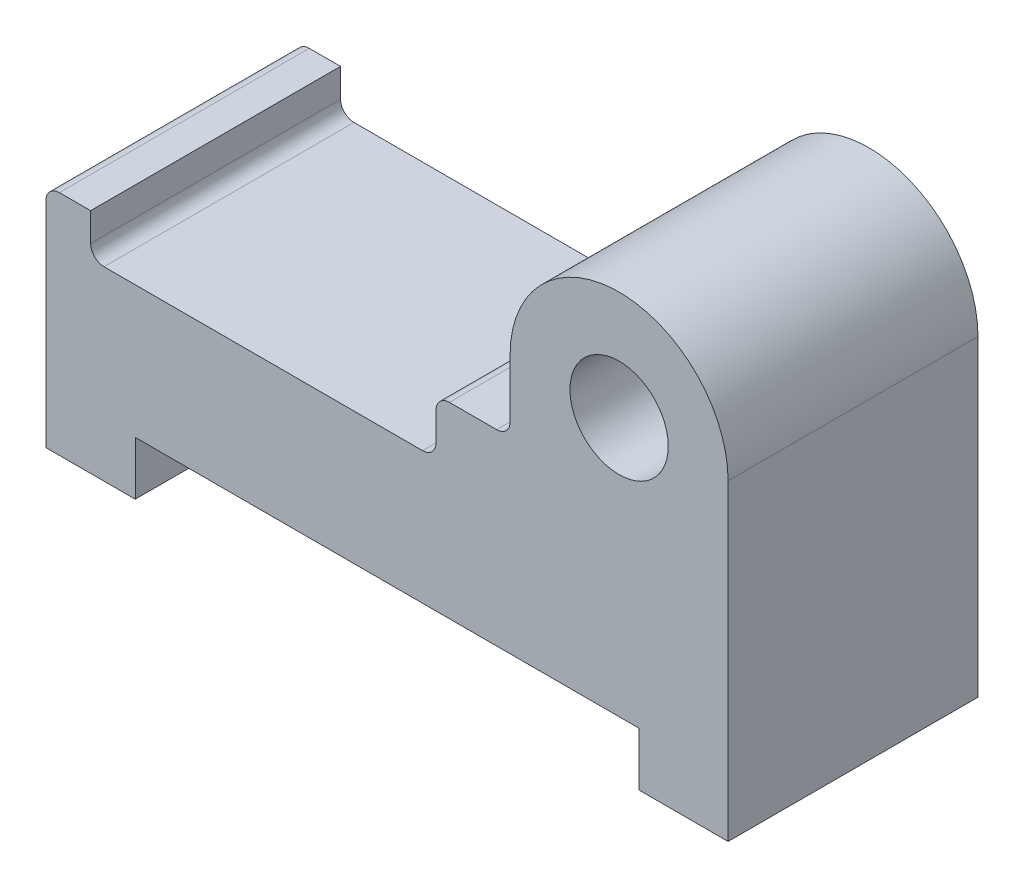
ISO-10303-21;
HEADER;
FILE_DESCRIPTION(('STEP AP214'),'2;1');
FILE_NAME('part.step','',(''),(''),'','','');
FILE_SCHEMA(('AUTOMOTIVE_DESIGN { 1 0 10303 214 1 1 1 1 }'));
ENDSEC;
DATA;
#1=APPLICATION_CONTEXT('core data for automotive mechanical design processes');
#2=APPLICATION_PROTOCOL_DEFINITION('international standard','automotive_design',2000,#1);
#3=PRODUCT_CONTEXT('',#1,'mechanical');
#4=PRODUCT('Part','Part','',(#3));
#5=PRODUCT_RELATED_PRODUCT_CATEGORY('part','',(#4));
#6=PRODUCT_DEFINITION_FORMATION('','',#4);
#7=PRODUCT_DEFINITION_CONTEXT('part definition',#1,'design');
#8=PRODUCT_DEFINITION('design','',#6,#7);
#9=PRODUCT_DEFINITION_SHAPE('','',#8);
#10=(LENGTH_UNIT() NAMED_UNIT(*) SI_UNIT(.MILLI.,.METRE.));
#11=(NAMED_UNIT(*) PLANE_ANGLE_UNIT() SI_UNIT($,.RADIAN.));
#12=(NAMED_UNIT(*) SI_UNIT($,.STERADIAN.) SOLID_ANGLE_UNIT());
#13=UNCERTAINTY_MEASURE_WITH_UNIT(LENGTH_MEASURE(1.E-05),#10,'distance_accuracy_value','');
#14=(GEOMETRIC_REPRESENTATION_CONTEXT(3) GLOBAL_UNCERTAINTY_ASSIGNED_CONTEXT((#13)) GLOBAL_UNIT_ASSIGNED_CONTEXT((#10,
#11,#12)) REPRESENTATION_CONTEXT('',''));
#15=CARTESIAN_POINT('',(0.,0.,0.));
#16=DIRECTION('',(0.,0.,1.));
#17=DIRECTION('',(1.,0.,0.));
#18=AXIS2_PLACEMENT_3D('',#15,#16,#17);
#19=CARTESIAN_POINT('',(128.425075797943,70.,56.));
#20=DIRECTION('',(0.,0.,1.));
#21=DIRECTION('',(1.,0.,0.));
#22=AXIS2_PLACEMENT_3D('',#19,#20,#21);
#23=PLANE('',#22);
#24=DIRECTION('',(0.,-1.,0.));
#25=VECTOR('',#24,1.);
#26=CARTESIAN_POINT('',(0.,48.,56.));
#27=LINE('',#26,#25);
#28=CARTESIAN_POINT('',(0.,48.,56.));
#29=VERTEX_POINT('',#28);
#30=CARTESIAN_POINT('',(0.,0.,56.));
#31=VERTEX_POINT('',#30);
#32=EDGE_CURVE('E230',#29,#31,#27,.T.);
#33=ORIENTED_EDGE('',*,*,#32,.T.);
#34=DIRECTION('',(1.,0.,0.));
#35=VECTOR('',#34,1.);
#36=CARTESIAN_POINT('',(0.,0.,56.));
#37=LINE('',#36,#35);
#38=CARTESIAN_POINT('',(20.,0.,56.));
#39=VERTEX_POINT('',#38);
#40=EDGE_CURVE('E123',#31,#39,#37,.T.);
#41=ORIENTED_EDGE('',*,*,#40,.T.);
#42=DIRECTION('',(0.,1.,0.));
#43=VECTOR('',#42,1.);
#44=CARTESIAN_POINT('',(20.,0.,56.));
#45=LINE('',#44,#43);
#46=CARTESIAN_POINT('',(20.,12.,56.));
#47=VERTEX_POINT('',#46);
#48=EDGE_CURVE('E278',#39,#47,#45,.T.);
#49=ORIENTED_EDGE('',*,*,#48,.T.);
#50=DIRECTION('',(1.,0.,0.));
#51=VECTOR('',#50,1.);
#52=CARTESIAN_POINT('',(20.,12.,56.));
#53=LINE('',#52,#51);
#54=CARTESIAN_POINT('',(132.850151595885,12.,56.));
#55=VERTEX_POINT('',#54);
#56=EDGE_CURVE('E297',#47,#55,#53,.T.);
#57=ORIENTED_EDGE('',*,*,#56,.T.);
#58=DIRECTION('',(0.,-1.,0.));
#59=VECTOR('',#58,1.);
#60=CARTESIAN_POINT('',(132.850151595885,12.,56.));
#61=LINE('',#60,#59);
#62=CARTESIAN_POINT('',(132.850151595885,0.,56.));
#63=VERTEX_POINT('',#62);
#64=EDGE_CURVE('E294',#55,#63,#61,.T.);
#65=ORIENTED_EDGE('',*,*,#64,.T.);
#66=DIRECTION('',(1.,0.,0.));
#67=VECTOR('',#66,1.);
#68=CARTESIAN_POINT('',(132.850151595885,0.,56.));
#69=LINE('',#68,#67);
#70=CARTESIAN_POINT('',(152.850151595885,0.,56.));
#71=VERTEX_POINT('',#70);
#72=EDGE_CURVE('E296',#63,#71,#69,.T.);
#73=ORIENTED_EDGE('',*,*,#72,.T.);
#74=DIRECTION('',(0.,1.,0.));
#75=VECTOR('',#74,1.);
#76=CARTESIAN_POINT('',(152.850151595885,0.,56.));
#77=LINE('',#76,#75);
#78=CARTESIAN_POINT('',(152.850151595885,70.,56.));
#79=VERTEX_POINT('',#78);
#80=EDGE_CURVE('E299',#71,#79,#77,.T.);
#81=ORIENTED_EDGE('',*,*,#80,.T.);
#82=CARTESIAN_POINT('',(128.425075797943,70.,56.));
#83=DIRECTION('',(0.,0.,1.));
#84=DIRECTION('',(1.,0.,0.));
#85=AXIS2_PLACEMENT_3D('',#82,#83,#84);
#86=CIRCLE('',#85,24.4250757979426);
#87=CARTESIAN_POINT('',(104.,70.,56.));
#88=VERTEX_POINT('',#87);
#89=EDGE_CURVE('E305',#79,#88,#86,.T.);
#90=ORIENTED_EDGE('',*,*,#89,.T.);
#91=DIRECTION('',(0.,-1.,0.));
#92=VECTOR('',#91,1.);
#93=CARTESIAN_POINT('',(104.,70.,56.));
#94=LINE('',#93,#92);
#95=CARTESIAN_POINT('',(104.,57.,56.));
#96=VERTEX_POINT('',#95);
#97=EDGE_CURVE('E307',#88,#96,#94,.T.);
#98=ORIENTED_EDGE('',*,*,#97,.T.);
#99=CARTESIAN_POINT('',(101.,57.,56.));
#100=DIRECTION('',(0.,0.,-1.));
#101=DIRECTION('',(-1.,0.,0.));
#102=AXIS2_PLACEMENT_3D('',#99,#100,#101);
#103=CIRCLE('',#102,3.00000000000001);
#104=CARTESIAN_POINT('',(101.,54.,56.));
#105=VERTEX_POINT('',#104);
#106=EDGE_CURVE('E309',#96,#105,#103,.T.);
#107=ORIENTED_EDGE('',*,*,#106,.T.);
#108=DIRECTION('',(-1.,0.,0.));
#109=VECTOR('',#108,1.);
#110=CARTESIAN_POINT('',(101.,54.,56.));
#111=LINE('',#110,#109);
#112=CARTESIAN_POINT('',(90.3994983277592,54.,56.));
#113=VERTEX_POINT('',#112);
#114=EDGE_CURVE('E311',#105,#113,#111,.T.);
#115=ORIENTED_EDGE('',*,*,#114,.T.);
#116=CARTESIAN_POINT('',(90.3994983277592,51.,56.));
#117=DIRECTION('',(0.,0.,1.));
#118=DIRECTION('',(1.,0.,0.));
#119=AXIS2_PLACEMENT_3D('',#116,#117,#118);
#120=CIRCLE('',#119,3.);
#121=CARTESIAN_POINT('',(87.3994983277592,51.,56.));
#122=VERTEX_POINT('',#121);
#123=EDGE_CURVE('E313',#113,#122,#120,.T.);
#124=ORIENTED_EDGE('',*,*,#123,.T.);
#125=DIRECTION('',(0.,-1.,0.));
#126=VECTOR('',#125,1.);
#127=CARTESIAN_POINT('',(87.3994983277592,51.,56.));
#128=LINE('',#127,#126);
#129=CARTESIAN_POINT('',(87.3994983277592,44.6174543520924,56.));
#130=VERTEX_POINT('',#129);
#131=EDGE_CURVE('E315',#122,#130,#128,.T.);
#132=ORIENTED_EDGE('',*,*,#131,.T.);
#133=CARTESIAN_POINT('',(84.3994983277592,44.6174543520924,56.));
#134=DIRECTION('',(0.,0.,-1.));
#135=DIRECTION('',(-1.,0.,0.));
#136=AXIS2_PLACEMENT_3D('',#133,#134,#135);
#137=CIRCLE('',#136,3.);
#138=CARTESIAN_POINT('',(84.3994983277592,41.6174543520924,56.));
#139=VERTEX_POINT('',#138);
#140=EDGE_CURVE('E317',#130,#139,#137,.T.);
#141=ORIENTED_EDGE('',*,*,#140,.T.);
#142=DIRECTION('',(-1.,0.,0.));
#143=VECTOR('',#142,1.);
#144=CARTESIAN_POINT('',(84.3994983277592,41.6174543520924,56.));
#145=LINE('',#144,#143);
#146=CARTESIAN_POINT('',(13.,41.6174543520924,56.));
#147=VERTEX_POINT('',#146);
#148=EDGE_CURVE('E319',#139,#147,#145,.T.);
#149=ORIENTED_EDGE('',*,*,#148,.T.);
#150=CARTESIAN_POINT('',(13.,44.6174543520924,56.));
#151=DIRECTION('',(0.,0.,-1.));
#152=DIRECTION('',(-1.,0.,0.));
#153=AXIS2_PLACEMENT_3D('',#150,#151,#152);
#154=CIRCLE('',#153,3.);
#155=CARTESIAN_POINT('',(10.,44.6174543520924,56.));
#156=VERTEX_POINT('',#155);
#157=EDGE_CURVE('E175',#147,#156,#154,.T.);
#158=ORIENTED_EDGE('',*,*,#157,.T.);
#159=DIRECTION('',(0.,1.,0.));
#160=VECTOR('',#159,1.);
#161=CARTESIAN_POINT('',(10.,44.6174543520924,56.));
#162=LINE('',#161,#160);
#163=CARTESIAN_POINT('',(10.,51.,56.));
#164=VERTEX_POINT('',#163);
#165=EDGE_CURVE('E169',#156,#164,#162,.T.);
#166=ORIENTED_EDGE('',*,*,#165,.T.);
#167=DIRECTION('',(-1.,0.,0.));
#168=VECTOR('',#167,1.);
#169=CARTESIAN_POINT('',(10.,51.,56.));
#170=LINE('',#169,#168);
#171=CARTESIAN_POINT('',(3.,51.,56.));
#172=VERTEX_POINT('',#171);
#173=EDGE_CURVE('E173',#164,#172,#170,.T.);
#174=ORIENTED_EDGE('',*,*,#173,.T.);
#175=CARTESIAN_POINT('',(3.,48.,56.));
#176=DIRECTION('',(0.,0.,1.));
#177=DIRECTION('',(1.,0.,0.));
#178=AXIS2_PLACEMENT_3D('',#175,#176,#177);
#179=CIRCLE('',#178,3.);
#180=EDGE_CURVE('E47',#172,#29,#179,.T.);
#181=ORIENTED_EDGE('',*,*,#180,.T.);
#182=EDGE_LOOP('',(#33,#41,#49,#57,#65,#73,#81,#90,#98,#107,#115,#124,#132,#141,#149,#158,#166,
#174,#181));
#183=FACE_BOUND('',#182,.T.);
#184=CARTESIAN_POINT('',(128.425075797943,70.,56.));
#185=DIRECTION('',(0.,0.,1.));
#186=DIRECTION('',(1.,0.,0.));
#187=AXIS2_PLACEMENT_3D('',#184,#185,#186);
#188=CIRCLE('',#187,11.0137221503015);
#189=CARTESIAN_POINT('',(139.438797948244,70.,56.));
#190=VERTEX_POINT('',#189);
#191=EDGE_CURVE('E197',#190,#190,#188,.T.);
#192=ORIENTED_EDGE('',*,*,#191,.F.);
#193=EDGE_LOOP('',(#192));
#194=FACE_BOUND('',#193,.T.);
#195=ADVANCED_FACE('F30',(#183,#194),#23,.T.);
#196=CARTESIAN_POINT('',(128.425075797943,70.,0.));
#197=DIRECTION('',(0.,0.,1.));
#198=DIRECTION('',(1.,0.,0.));
#199=AXIS2_PLACEMENT_3D('',#196,#197,#198);
#200=PLANE('',#199);
#201=DIRECTION('',(0.,-1.,0.));
#202=VECTOR('',#201,1.);
#203=CARTESIAN_POINT('',(0.,48.,0.));
#204=LINE('',#203,#202);
#205=CARTESIAN_POINT('',(0.,48.,0.));
#206=VERTEX_POINT('',#205);
#207=CARTESIAN_POINT('',(0.,0.,0.));
#208=VERTEX_POINT('',#207);
#209=EDGE_CURVE('E193',#206,#208,#204,.T.);
#210=ORIENTED_EDGE('',*,*,#209,.F.);
#211=CARTESIAN_POINT('',(3.,48.,0.));
#212=DIRECTION('',(0.,0.,1.));
#213=DIRECTION('',(1.,0.,0.));
#214=AXIS2_PLACEMENT_3D('',#211,#212,#213);
#215=CIRCLE('',#214,3.);
#216=CARTESIAN_POINT('',(3.,51.,0.));
#217=VERTEX_POINT('',#216);
#218=EDGE_CURVE('E115',#217,#206,#215,.T.);
#219=ORIENTED_EDGE('',*,*,#218,.F.);
#220=DIRECTION('',(-1.,0.,0.));
#221=VECTOR('',#220,1.);
#222=CARTESIAN_POINT('',(10.,51.,0.));
#223=LINE('',#222,#221);
#224=CARTESIAN_POINT('',(10.,51.,0.));
#225=VERTEX_POINT('',#224);
#226=EDGE_CURVE('E109',#225,#217,#223,.T.);
#227=ORIENTED_EDGE('',*,*,#226,.F.);
#228=DIRECTION('',(0.,1.,0.));
#229=VECTOR('',#228,1.);
#230=CARTESIAN_POINT('',(10.,44.6174543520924,0.));
#231=LINE('',#230,#229);
#232=CARTESIAN_POINT('',(10.,44.6174543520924,0.));
#233=VERTEX_POINT('',#232);
#234=EDGE_CURVE('E183',#233,#225,#231,.T.);
#235=ORIENTED_EDGE('',*,*,#234,.F.);
#236=CARTESIAN_POINT('',(13.,44.6174543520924,0.));
#237=DIRECTION('',(0.,0.,-1.));
#238=DIRECTION('',(-1.,0.,0.));
#239=AXIS2_PLACEMENT_3D('',#236,#237,#238);
#240=CIRCLE('',#239,3.);
#241=CARTESIAN_POINT('',(13.,41.6174543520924,0.));
#242=VERTEX_POINT('',#241);
#243=EDGE_CURVE('E225',#242,#233,#240,.T.);
#244=ORIENTED_EDGE('',*,*,#243,.F.);
#245=DIRECTION('',(-1.,0.,0.));
#246=VECTOR('',#245,1.);
#247=CARTESIAN_POINT('',(84.3994983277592,41.6174543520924,0.));
#248=LINE('',#247,#246);
#249=CARTESIAN_POINT('',(84.3994983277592,41.6174543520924,0.));
#250=VERTEX_POINT('',#249);
#251=EDGE_CURVE('E223',#250,#242,#248,.T.);
#252=ORIENTED_EDGE('',*,*,#251,.F.);
#253=CARTESIAN_POINT('',(84.3994983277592,44.6174543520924,0.));
#254=DIRECTION('',(0.,0.,-1.));
#255=DIRECTION('',(-1.,0.,0.));
#256=AXIS2_PLACEMENT_3D('',#253,#254,#255);
#257=CIRCLE('',#256,3.);
#258=CARTESIAN_POINT('',(87.3994983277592,44.6174543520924,0.));
#259=VERTEX_POINT('',#258);
#260=EDGE_CURVE('E221',#259,#250,#257,.T.);
#261=ORIENTED_EDGE('',*,*,#260,.F.);
#262=DIRECTION('',(0.,-1.,0.));
#263=VECTOR('',#262,1.);
#264=CARTESIAN_POINT('',(87.3994983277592,51.,0.));
#265=LINE('',#264,#263);
#266=CARTESIAN_POINT('',(87.3994983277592,51.,0.));
#267=VERTEX_POINT('',#266);
#268=EDGE_CURVE('E219',#267,#259,#265,.T.);
#269=ORIENTED_EDGE('',*,*,#268,.F.);
#270=CARTESIAN_POINT('',(90.3994983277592,51.,0.));
#271=DIRECTION('',(0.,0.,1.));
#272=DIRECTION('',(1.,0.,0.));
#273=AXIS2_PLACEMENT_3D('',#270,#271,#272);
#274=CIRCLE('',#273,3.);
#275=CARTESIAN_POINT('',(90.3994983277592,54.,0.));
#276=VERTEX_POINT('',#275);
#277=EDGE_CURVE('E217',#276,#267,#274,.T.);
#278=ORIENTED_EDGE('',*,*,#277,.F.);
#279=DIRECTION('',(-1.,0.,0.));
#280=VECTOR('',#279,1.);
#281=CARTESIAN_POINT('',(101.,54.,0.));
#282=LINE('',#281,#280);
#283=CARTESIAN_POINT('',(101.,54.,0.));
#284=VERTEX_POINT('',#283);
#285=EDGE_CURVE('E215',#284,#276,#282,.T.);
#286=ORIENTED_EDGE('',*,*,#285,.F.);
#287=CARTESIAN_POINT('',(101.,57.,0.));
#288=DIRECTION('',(0.,0.,-1.));
#289=DIRECTION('',(-1.,0.,0.));
#290=AXIS2_PLACEMENT_3D('',#287,#288,#289);
#291=CIRCLE('',#290,3.00000000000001);
#292=CARTESIAN_POINT('',(104.,57.,0.));
#293=VERTEX_POINT('',#292);
#294=EDGE_CURVE('E213',#293,#284,#291,.T.);
#295=ORIENTED_EDGE('',*,*,#294,.F.);
#296=DIRECTION('',(0.,-1.,0.));
#297=VECTOR('',#296,1.);
#298=CARTESIAN_POINT('',(104.,70.,0.));
#299=LINE('',#298,#297);
#300=CARTESIAN_POINT('',(104.,70.,0.));
#301=VERTEX_POINT('',#300);
#302=EDGE_CURVE('E211',#301,#293,#299,.T.);
#303=ORIENTED_EDGE('',*,*,#302,.F.);
#304=CARTESIAN_POINT('',(128.425075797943,70.,0.));
#305=DIRECTION('',(0.,0.,1.));
#306=DIRECTION('',(1.,0.,0.));
#307=AXIS2_PLACEMENT_3D('',#304,#305,#306);
#308=CIRCLE('',#307,24.4250757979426);
#309=CARTESIAN_POINT('',(152.850151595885,70.,0.));
#310=VERTEX_POINT('',#309);
#311=EDGE_CURVE('E209',#310,#301,#308,.T.);
#312=ORIENTED_EDGE('',*,*,#311,.F.);
#313=DIRECTION('',(0.,1.,0.));
#314=VECTOR('',#313,1.);
#315=CARTESIAN_POINT('',(152.850151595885,0.,0.));
#316=LINE('',#315,#314);
#317=CARTESIAN_POINT('',(152.850151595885,0.,0.));
#318=VERTEX_POINT('',#317);
#319=EDGE_CURVE('E207',#318,#310,#316,.T.);
#320=ORIENTED_EDGE('',*,*,#319,.F.);
#321=DIRECTION('',(1.,0.,0.));
#322=VECTOR('',#321,1.);
#323=CARTESIAN_POINT('',(132.850151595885,0.,0.));
#324=LINE('',#323,#322);
#325=CARTESIAN_POINT('',(132.850151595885,0.,0.));
#326=VERTEX_POINT('',#325);
#327=EDGE_CURVE('E205',#326,#318,#324,.T.);
#328=ORIENTED_EDGE('',*,*,#327,.F.);
#329=DIRECTION('',(0.,-1.,0.));
#330=VECTOR('',#329,1.);
#331=CARTESIAN_POINT('',(132.850151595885,12.,0.));
#332=LINE('',#331,#330);
#333=CARTESIAN_POINT('',(132.850151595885,12.,0.));
#334=VERTEX_POINT('',#333);
#335=EDGE_CURVE('E203',#334,#326,#332,.T.);
#336=ORIENTED_EDGE('',*,*,#335,.F.);
#337=DIRECTION('',(1.,0.,0.));
#338=VECTOR('',#337,1.);
#339=CARTESIAN_POINT('',(20.,12.,0.));
#340=LINE('',#339,#338);
#341=CARTESIAN_POINT('',(20.,12.,0.));
#342=VERTEX_POINT('',#341);
#343=EDGE_CURVE('E201',#342,#334,#340,.T.);
#344=ORIENTED_EDGE('',*,*,#343,.F.);
#345=DIRECTION('',(0.,1.,0.));
#346=VECTOR('',#345,1.);
#347=CARTESIAN_POINT('',(20.,0.,0.));
#348=LINE('',#347,#346);
#349=CARTESIAN_POINT('',(20.,0.,0.));
#350=VERTEX_POINT('',#349);
#351=EDGE_CURVE('E199',#350,#342,#348,.T.);
#352=ORIENTED_EDGE('',*,*,#351,.F.);
#353=DIRECTION('',(1.,0.,0.));
#354=VECTOR('',#353,1.);
#355=CARTESIAN_POINT('',(0.,0.,0.));
#356=LINE('',#355,#354);
#357=EDGE_CURVE('E196',#208,#350,#356,.T.);
#358=ORIENTED_EDGE('',*,*,#357,.F.);
#359=EDGE_LOOP('',(#210,#219,#227,#235,#244,#252,#261,#269,#278,#286,#295,#303,#312,#320,#328,
#336,#344,#352,#358));
#360=FACE_BOUND('',#359,.T.);
#361=CARTESIAN_POINT('',(128.425075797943,70.,0.));
#362=DIRECTION('',(0.,0.,1.));
#363=DIRECTION('',(1.,0.,0.));
#364=AXIS2_PLACEMENT_3D('',#361,#362,#363);
#365=CIRCLE('',#364,11.0137221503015);
#366=CARTESIAN_POINT('',(139.438797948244,70.,0.));
#367=VERTEX_POINT('',#366);
#368=EDGE_CURVE('E557',#367,#367,#365,.T.);
#369=ORIENTED_EDGE('',*,*,#368,.T.);
#370=EDGE_LOOP('',(#369));
#371=FACE_BOUND('',#370,.T.);
#372=ADVANCED_FACE('F282',(#360,#371),#200,.F.);
#373=CARTESIAN_POINT('',(0.,48.,56.));
#374=DIRECTION('',(1.,0.,0.));
#375=DIRECTION('',(0.,1.,0.));
#376=AXIS2_PLACEMENT_3D('',#373,#374,#375);
#377=PLANE('',#376);
#378=ORIENTED_EDGE('',*,*,#209,.T.);
#379=DIRECTION('',(0.,0.,-1.));
#380=VECTOR('',#379,1.);
#381=CARTESIAN_POINT('',(0.,0.,56.));
#382=LINE('',#381,#380);
#383=EDGE_CURVE('E11',#31,#208,#382,.T.);
#384=ORIENTED_EDGE('',*,*,#383,.F.);
#385=ORIENTED_EDGE('',*,*,#32,.F.);
#386=DIRECTION('',(0.,0.,-1.));
#387=VECTOR('',#386,1.);
#388=CARTESIAN_POINT('',(0.,48.,56.));
#389=LINE('',#388,#387);
#390=EDGE_CURVE('E189',#29,#206,#389,.T.);
#391=ORIENTED_EDGE('',*,*,#390,.T.);
#392=EDGE_LOOP('',(#378,#384,#385,#391));
#393=FACE_BOUND('',#392,.T.);
#394=ADVANCED_FACE('F32',(#393),#377,.F.);
#395=CARTESIAN_POINT('',(0.,0.,56.));
#396=DIRECTION('',(0.,1.,0.));
#397=DIRECTION('',(0.,0.,1.));
#398=AXIS2_PLACEMENT_3D('',#395,#396,#397);
#399=PLANE('',#398);
#400=ORIENTED_EDGE('',*,*,#357,.T.);
#401=DIRECTION('',(0.,0.,-1.));
#402=VECTOR('',#401,1.);
#403=CARTESIAN_POINT('',(20.,0.,56.));
#404=LINE('',#403,#402);
#405=EDGE_CURVE('E39',#39,#350,#404,.T.);
#406=ORIENTED_EDGE('',*,*,#405,.F.);
#407=ORIENTED_EDGE('',*,*,#40,.F.);
#408=ORIENTED_EDGE('',*,*,#383,.T.);
#409=EDGE_LOOP('',(#400,#406,#407,#408));
#410=FACE_BOUND('',#409,.T.);
#411=ADVANCED_FACE('F353',(#410),#399,.F.);
#412=CARTESIAN_POINT('',(20.,0.,56.));
#413=DIRECTION('',(-1.,0.,0.));
#414=DIRECTION('',(0.,0.,1.));
#415=AXIS2_PLACEMENT_3D('',#412,#413,#414);
#416=PLANE('',#415);
#417=ORIENTED_EDGE('',*,*,#351,.T.);
#418=DIRECTION('',(0.,0.,-1.));
#419=VECTOR('',#418,1.);
#420=CARTESIAN_POINT('',(20.,12.,56.));
#421=LINE('',#420,#419);
#422=EDGE_CURVE('E270',#47,#342,#421,.T.);
#423=ORIENTED_EDGE('',*,*,#422,.F.);
#424=ORIENTED_EDGE('',*,*,#48,.F.);
#425=ORIENTED_EDGE('',*,*,#405,.T.);
#426=EDGE_LOOP('',(#417,#423,#424,#425));
#427=FACE_BOUND('',#426,.T.);
#428=ADVANCED_FACE('F276',(#427),#416,.F.);
#429=CARTESIAN_POINT('',(20.,12.,56.));
#430=DIRECTION('',(0.,1.,0.));
#431=DIRECTION('',(0.,0.,1.));
#432=AXIS2_PLACEMENT_3D('',#429,#430,#431);
#433=PLANE('',#432);
#434=ORIENTED_EDGE('',*,*,#343,.T.);
#435=DIRECTION('',(0.,0.,-1.));
#436=VECTOR('',#435,1.);
#437=CARTESIAN_POINT('',(132.850151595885,12.,56.));
#438=LINE('',#437,#436);
#439=EDGE_CURVE('E267',#55,#334,#438,.T.);
#440=ORIENTED_EDGE('',*,*,#439,.F.);
#441=ORIENTED_EDGE('',*,*,#56,.F.);
#442=ORIENTED_EDGE('',*,*,#422,.T.);
#443=EDGE_LOOP('',(#434,#440,#441,#442));
#444=FACE_BOUND('',#443,.T.);
#445=ADVANCED_FACE('F288',(#444),#433,.F.);
#446=CARTESIAN_POINT('',(132.850151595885,12.,56.));
#447=DIRECTION('',(1.,0.,0.));
#448=DIRECTION('',(0.,0.,-1.));
#449=AXIS2_PLACEMENT_3D('',#446,#447,#448);
#450=PLANE('',#449);
#451=ORIENTED_EDGE('',*,*,#335,.T.);
#452=DIRECTION('',(0.,0.,-1.));
#453=VECTOR('',#452,1.);
#454=CARTESIAN_POINT('',(132.850151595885,0.,56.));
#455=LINE('',#454,#453);
#456=EDGE_CURVE('E264',#63,#326,#455,.T.);
#457=ORIENTED_EDGE('',*,*,#456,.F.);
#458=ORIENTED_EDGE('',*,*,#64,.F.);
#459=ORIENTED_EDGE('',*,*,#439,.T.);
#460=EDGE_LOOP('',(#451,#457,#458,#459));
#461=FACE_BOUND('',#460,.T.);
#462=ADVANCED_FACE('F292',(#461),#450,.F.);
#463=CARTESIAN_POINT('',(132.850151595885,0.,56.));
#464=DIRECTION('',(0.,1.,0.));
#465=DIRECTION('',(0.,0.,1.));
#466=AXIS2_PLACEMENT_3D('',#463,#464,#465);
#467=PLANE('',#466);
#468=ORIENTED_EDGE('',*,*,#327,.T.);
#469=DIRECTION('',(0.,0.,-1.));
#470=VECTOR('',#469,1.);
#471=CARTESIAN_POINT('',(152.850151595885,0.,56.));
#472=LINE('',#471,#470);
#473=EDGE_CURVE('E261',#71,#318,#472,.T.);
#474=ORIENTED_EDGE('',*,*,#473,.F.);
#475=ORIENTED_EDGE('',*,*,#72,.F.);
#476=ORIENTED_EDGE('',*,*,#456,.T.);
#477=EDGE_LOOP('',(#468,#474,#475,#476));
#478=FACE_BOUND('',#477,.T.);
#479=ADVANCED_FACE('F366',(#478),#467,.F.);
#480=CARTESIAN_POINT('',(152.850151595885,0.,56.));
#481=DIRECTION('',(-1.,0.,0.));
#482=DIRECTION('',(0.,-1.,0.));
#483=AXIS2_PLACEMENT_3D('',#480,#481,#482);
#484=PLANE('',#483);
#485=ORIENTED_EDGE('',*,*,#319,.T.);
#486=DIRECTION('',(0.,0.,-1.));
#487=VECTOR('',#486,1.);
#488=CARTESIAN_POINT('',(152.850151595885,70.,56.));
#489=LINE('',#488,#487);
#490=EDGE_CURVE('E258',#79,#310,#489,.T.);
#491=ORIENTED_EDGE('',*,*,#490,.F.);
#492=ORIENTED_EDGE('',*,*,#80,.F.);
#493=ORIENTED_EDGE('',*,*,#473,.T.);
#494=EDGE_LOOP('',(#485,#491,#492,#493));
#495=FACE_BOUND('',#494,.T.);
#496=ADVANCED_FACE('F369',(#495),#484,.F.);
#497=CARTESIAN_POINT('',(128.425075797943,70.,56.));
#498=DIRECTION('',(0.,0.,-1.));
#499=DIRECTION('',(-1.,0.,0.));
#500=AXIS2_PLACEMENT_3D('',#497,#498,#499);
#501=CYLINDRICAL_SURFACE('',#500,24.4250757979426);
#502=ORIENTED_EDGE('',*,*,#311,.T.);
#503=DIRECTION('',(0.,0.,-1.));
#504=VECTOR('',#503,1.);
#505=CARTESIAN_POINT('',(104.,70.,56.));
#506=LINE('',#505,#504);
#507=EDGE_CURVE('E255',#88,#301,#506,.T.);
#508=ORIENTED_EDGE('',*,*,#507,.F.);
#509=ORIENTED_EDGE('',*,*,#89,.F.);
#510=ORIENTED_EDGE('',*,*,#490,.T.);
#511=EDGE_LOOP('',(#502,#508,#509,#510));
#512=FACE_BOUND('',#511,.T.);
#513=ADVANCED_FACE('F373',(#512),#501,.T.);
#514=CARTESIAN_POINT('',(104.,70.,56.));
#515=DIRECTION('',(1.,0.,0.));
#516=DIRECTION('',(0.,1.,0.));
#517=AXIS2_PLACEMENT_3D('',#514,#515,#516);
#518=PLANE('',#517);
#519=ORIENTED_EDGE('',*,*,#302,.T.);
#520=DIRECTION('',(0.,0.,-1.));
#521=VECTOR('',#520,1.);
#522=CARTESIAN_POINT('',(104.,57.,56.));
#523=LINE('',#522,#521);
#524=EDGE_CURVE('E252',#96,#293,#523,.T.);
#525=ORIENTED_EDGE('',*,*,#524,.F.);
#526=ORIENTED_EDGE('',*,*,#97,.F.);
#527=ORIENTED_EDGE('',*,*,#507,.T.);
#528=EDGE_LOOP('',(#519,#525,#526,#527));
#529=FACE_BOUND('',#528,.T.);
#530=ADVANCED_FACE('F377',(#529),#518,.F.);
#531=CARTESIAN_POINT('',(101.,57.,56.));
#532=DIRECTION('',(0.,0.,-1.));
#533=DIRECTION('',(-1.,0.,0.));
#534=AXIS2_PLACEMENT_3D('',#531,#532,#533);
#535=CYLINDRICAL_SURFACE('',#534,3.00000000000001);
#536=ORIENTED_EDGE('',*,*,#294,.T.);
#537=DIRECTION('',(0.,0.,-1.));
#538=VECTOR('',#537,1.);
#539=CARTESIAN_POINT('',(101.,54.,56.));
#540=LINE('',#539,#538);
#541=EDGE_CURVE('E249',#105,#284,#540,.T.);
#542=ORIENTED_EDGE('',*,*,#541,.F.);
#543=ORIENTED_EDGE('',*,*,#106,.F.);
#544=ORIENTED_EDGE('',*,*,#524,.T.);
#545=EDGE_LOOP('',(#536,#542,#543,#544));
#546=FACE_BOUND('',#545,.T.);
#547=ADVANCED_FACE('F381',(#546),#535,.F.);
#548=CARTESIAN_POINT('',(101.,54.,56.));
#549=DIRECTION('',(0.,-1.,0.));
#550=DIRECTION('',(1.,0.,0.));
#551=AXIS2_PLACEMENT_3D('',#548,#549,#550);
#552=PLANE('',#551);
#553=ORIENTED_EDGE('',*,*,#285,.T.);
#554=DIRECTION('',(0.,0.,-1.));
#555=VECTOR('',#554,1.);
#556=CARTESIAN_POINT('',(90.3994983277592,54.,56.));
#557=LINE('',#556,#555);
#558=EDGE_CURVE('E246',#113,#276,#557,.T.);
#559=ORIENTED_EDGE('',*,*,#558,.F.);
#560=ORIENTED_EDGE('',*,*,#114,.F.);
#561=ORIENTED_EDGE('',*,*,#541,.T.);
#562=EDGE_LOOP('',(#553,#559,#560,#561));
#563=FACE_BOUND('',#562,.T.);
#564=ADVANCED_FACE('F385',(#563),#552,.F.);
#565=CARTESIAN_POINT('',(90.3994983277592,51.,56.));
#566=DIRECTION('',(0.,0.,-1.));
#567=DIRECTION('',(-1.,0.,0.));
#568=AXIS2_PLACEMENT_3D('',#565,#566,#567);
#569=CYLINDRICAL_SURFACE('',#568,3.);
#570=ORIENTED_EDGE('',*,*,#277,.T.);
#571=DIRECTION('',(0.,0.,-1.));
#572=VECTOR('',#571,1.);
#573=CARTESIAN_POINT('',(87.3994983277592,51.,56.));
#574=LINE('',#573,#572);
#575=EDGE_CURVE('E243',#122,#267,#574,.T.);
#576=ORIENTED_EDGE('',*,*,#575,.F.);
#577=ORIENTED_EDGE('',*,*,#123,.F.);
#578=ORIENTED_EDGE('',*,*,#558,.T.);
#579=EDGE_LOOP('',(#570,#576,#577,#578));
#580=FACE_BOUND('',#579,.T.);
#581=ADVANCED_FACE('F389',(#580),#569,.T.);
#582=CARTESIAN_POINT('',(87.3994983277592,51.,56.));
#583=DIRECTION('',(1.,0.,0.));
#584=DIRECTION('',(0.,0.,-1.));
#585=AXIS2_PLACEMENT_3D('',#582,#583,#584);
#586=PLANE('',#585);
#587=ORIENTED_EDGE('',*,*,#268,.T.);
#588=DIRECTION('',(0.,0.,-1.));
#589=VECTOR('',#588,1.);
#590=CARTESIAN_POINT('',(87.3994983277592,44.6174543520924,56.));
#591=LINE('',#590,#589);
#592=EDGE_CURVE('E240',#130,#259,#591,.T.);
#593=ORIENTED_EDGE('',*,*,#592,.F.);
#594=ORIENTED_EDGE('',*,*,#131,.F.);
#595=ORIENTED_EDGE('',*,*,#575,.T.);
#596=EDGE_LOOP('',(#587,#593,#594,#595));
#597=FACE_BOUND('',#596,.T.);
#598=ADVANCED_FACE('F393',(#597),#586,.F.);
#599=CARTESIAN_POINT('',(84.3994983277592,44.6174543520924,56.));
#600=DIRECTION('',(0.,0.,-1.));
#601=DIRECTION('',(-1.,0.,0.));
#602=AXIS2_PLACEMENT_3D('',#599,#600,#601);
#603=CYLINDRICAL_SURFACE('',#602,3.);
#604=ORIENTED_EDGE('',*,*,#260,.T.);
#605=DIRECTION('',(0.,0.,-1.));
#606=VECTOR('',#605,1.);
#607=CARTESIAN_POINT('',(84.3994983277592,41.6174543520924,56.));
#608=LINE('',#607,#606);
#609=EDGE_CURVE('E237',#139,#250,#608,.T.);
#610=ORIENTED_EDGE('',*,*,#609,.F.);
#611=ORIENTED_EDGE('',*,*,#140,.F.);
#612=ORIENTED_EDGE('',*,*,#592,.T.);
#613=EDGE_LOOP('',(#604,#610,#611,#612));
#614=FACE_BOUND('',#613,.T.);
#615=ADVANCED_FACE('F397',(#614),#603,.F.);
#616=CARTESIAN_POINT('',(84.3994983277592,41.6174543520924,56.));
#617=DIRECTION('',(0.,-1.,0.));
#618=DIRECTION('',(1.,0.,0.));
#619=AXIS2_PLACEMENT_3D('',#616,#617,#618);
#620=PLANE('',#619);
#621=ORIENTED_EDGE('',*,*,#251,.T.);
#622=DIRECTION('',(0.,0.,-1.));
#623=VECTOR('',#622,1.);
#624=CARTESIAN_POINT('',(13.,41.6174543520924,56.));
#625=LINE('',#624,#623);
#626=EDGE_CURVE('E234',#147,#242,#625,.T.);
#627=ORIENTED_EDGE('',*,*,#626,.F.);
#628=ORIENTED_EDGE('',*,*,#148,.F.);
#629=ORIENTED_EDGE('',*,*,#609,.T.);
#630=EDGE_LOOP('',(#621,#627,#628,#629));
#631=FACE_BOUND('',#630,.T.);
#632=ADVANCED_FACE('F325',(#631),#620,.F.);
#633=CARTESIAN_POINT('',(13.,44.6174543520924,56.));
#634=DIRECTION('',(0.,0.,-1.));
#635=DIRECTION('',(-1.,0.,0.));
#636=AXIS2_PLACEMENT_3D('',#633,#634,#635);
#637=CYLINDRICAL_SURFACE('',#636,3.);
#638=ORIENTED_EDGE('',*,*,#243,.T.);
#639=DIRECTION('',(0.,0.,-1.));
#640=VECTOR('',#639,1.);
#641=CARTESIAN_POINT('',(10.,44.6174543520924,56.));
#642=LINE('',#641,#640);
#643=EDGE_CURVE('E184',#156,#233,#642,.T.);
#644=ORIENTED_EDGE('',*,*,#643,.F.);
#645=ORIENTED_EDGE('',*,*,#157,.F.);
#646=ORIENTED_EDGE('',*,*,#626,.T.);
#647=EDGE_LOOP('',(#638,#644,#645,#646));
#648=FACE_BOUND('',#647,.T.);
#649=ADVANCED_FACE('F329',(#648),#637,.F.);
#650=CARTESIAN_POINT('',(10.,44.6174543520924,56.));
#651=DIRECTION('',(-1.,0.,0.));
#652=DIRECTION('',(0.,0.,1.));
#653=AXIS2_PLACEMENT_3D('',#650,#651,#652);
#654=PLANE('',#653);
#655=ORIENTED_EDGE('',*,*,#234,.T.);
#656=DIRECTION('',(0.,0.,-1.));
#657=VECTOR('',#656,1.);
#658=CARTESIAN_POINT('',(10.,51.,56.));
#659=LINE('',#658,#657);
#660=EDGE_CURVE('E180',#164,#225,#659,.T.);
#661=ORIENTED_EDGE('',*,*,#660,.F.);
#662=ORIENTED_EDGE('',*,*,#165,.F.);
#663=ORIENTED_EDGE('',*,*,#643,.T.);
#664=EDGE_LOOP('',(#655,#661,#662,#663));
#665=FACE_BOUND('',#664,.T.);
#666=ADVANCED_FACE('F181',(#665),#654,.F.);
#667=CARTESIAN_POINT('',(10.,51.,56.));
#668=DIRECTION('',(0.,-1.,0.));
#669=DIRECTION('',(0.,0.,-1.));
#670=AXIS2_PLACEMENT_3D('',#667,#668,#669);
#671=PLANE('',#670);
#672=ORIENTED_EDGE('',*,*,#226,.T.);
#673=DIRECTION('',(0.,0.,-1.));
#674=VECTOR('',#673,1.);
#675=CARTESIAN_POINT('',(3.,51.,56.));
#676=LINE('',#675,#674);
#677=EDGE_CURVE('E185',#172,#217,#676,.T.);
#678=ORIENTED_EDGE('',*,*,#677,.F.);
#679=ORIENTED_EDGE('',*,*,#173,.F.);
#680=ORIENTED_EDGE('',*,*,#660,.T.);
#681=EDGE_LOOP('',(#672,#678,#679,#680));
#682=FACE_BOUND('',#681,.T.);
#683=ADVANCED_FACE('F187',(#682),#671,.F.);
#684=CARTESIAN_POINT('',(3.,48.,56.));
#685=DIRECTION('',(0.,0.,-1.));
#686=DIRECTION('',(-1.,0.,0.));
#687=AXIS2_PLACEMENT_3D('',#684,#685,#686);
#688=CYLINDRICAL_SURFACE('',#687,3.);
#689=ORIENTED_EDGE('',*,*,#218,.T.);
#690=ORIENTED_EDGE('',*,*,#390,.F.);
#691=ORIENTED_EDGE('',*,*,#180,.F.);
#692=ORIENTED_EDGE('',*,*,#677,.T.);
#693=EDGE_LOOP('',(#689,#690,#691,#692));
#694=FACE_BOUND('',#693,.T.);
#695=ADVANCED_FACE('F333',(#694),#688,.T.);
#696=CARTESIAN_POINT('',(128.425075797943,70.,56.));
#697=DIRECTION('',(0.,0.,-1.));
#698=DIRECTION('',(-1.,0.,0.));
#699=AXIS2_PLACEMENT_3D('',#696,#697,#698);
#700=CYLINDRICAL_SURFACE('',#699,11.0137221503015);
#701=ORIENTED_EDGE('',*,*,#191,.T.);
#702=EDGE_LOOP('',(#701));
#703=FACE_BOUND('',#702,.T.);
#704=ORIENTED_EDGE('',*,*,#368,.F.);
#705=EDGE_LOOP('',(#704));
#706=FACE_BOUND('',#705,.T.);
#707=ADVANCED_FACE('F335',(#703,#706),#700,.F.);
#708=CLOSED_SHELL('',(#195,#372,#394,#411,#428,#445,#462,#479,#496,#513,#530,#547,#564,#581,
#598,#615,#632,#649,#666,#683,#695,#707));
#709=MANIFOLD_SOLID_BREP('B2',#708);
#710=ADVANCED_BREP_SHAPE_REPRESENTATION('',(#18,#709),#14);
#711=SHAPE_DEFINITION_REPRESENTATION(#9,#710);
ENDSEC;
END-ISO-10303-21;
